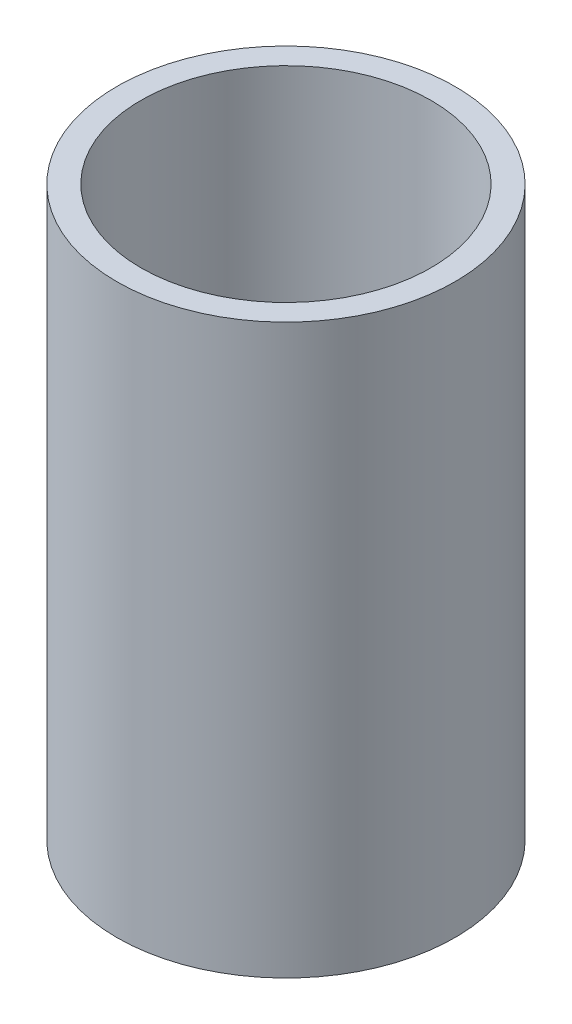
ISO-10303-21;
HEADER;
FILE_DESCRIPTION(('STEP AP214'),'2;1');
FILE_NAME('part.step','',(''),(''),'','','');
FILE_SCHEMA(('AUTOMOTIVE_DESIGN { 1 0 10303 214 1 1 1 1 }'));
ENDSEC;
DATA;
#1=APPLICATION_CONTEXT('core data for automotive mechanical design processes');
#2=APPLICATION_PROTOCOL_DEFINITION('international standard','automotive_design',2000,#1);
#3=PRODUCT_CONTEXT('',#1,'mechanical');
#4=PRODUCT('Part','Part','',(#3));
#5=PRODUCT_RELATED_PRODUCT_CATEGORY('part','',(#4));
#6=PRODUCT_DEFINITION_FORMATION('','',#4);
#7=PRODUCT_DEFINITION_CONTEXT('part definition',#1,'design');
#8=PRODUCT_DEFINITION('design','',#6,#7);
#9=PRODUCT_DEFINITION_SHAPE('','',#8);
#10=(LENGTH_UNIT() NAMED_UNIT(*) SI_UNIT(.MILLI.,.METRE.));
#11=(NAMED_UNIT(*) PLANE_ANGLE_UNIT() SI_UNIT($,.RADIAN.));
#12=(NAMED_UNIT(*) SI_UNIT($,.STERADIAN.) SOLID_ANGLE_UNIT());
#13=UNCERTAINTY_MEASURE_WITH_UNIT(LENGTH_MEASURE(1.E-05),#10,'distance_accuracy_value','');
#14=(GEOMETRIC_REPRESENTATION_CONTEXT(3) GLOBAL_UNCERTAINTY_ASSIGNED_CONTEXT((#13)) GLOBAL_UNIT_ASSIGNED_CONTEXT((#10,
#11,#12)) REPRESENTATION_CONTEXT('',''));
#15=CARTESIAN_POINT('',(0.,0.,0.));
#16=DIRECTION('',(0.,0.,1.));
#17=DIRECTION('',(1.,0.,0.));
#18=AXIS2_PLACEMENT_3D('',#15,#16,#17);
#19=CARTESIAN_POINT('',(0.,279.4,0.));
#20=DIRECTION('',(0.,1.,0.));
#21=DIRECTION('',(0.,0.,1.));
#22=AXIS2_PLACEMENT_3D('',#19,#20,#21);
#23=PLANE('',#22);
#24=CARTESIAN_POINT('',(0.,279.4,0.));
#25=DIRECTION('',(0.,1.,0.));
#26=DIRECTION('',(0.,0.,1.));
#27=AXIS2_PLACEMENT_3D('',#24,#25,#26);
#28=CIRCLE('',#27,83.185);
#29=CARTESIAN_POINT('',(0.,279.4,83.185));
#30=VERTEX_POINT('',#29);
#31=EDGE_CURVE('E42',#30,#30,#28,.T.);
#32=ORIENTED_EDGE('',*,*,#31,.T.);
#33=EDGE_LOOP('',(#32));
#34=FACE_BOUND('',#33,.T.);
#35=CARTESIAN_POINT('',(0.,279.4,0.));
#36=DIRECTION('',(0.,1.,0.));
#37=DIRECTION('',(0.,0.,1.));
#38=AXIS2_PLACEMENT_3D('',#35,#36,#37);
#39=CIRCLE('',#38,71.352522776);
#40=CARTESIAN_POINT('',(0.,279.4,71.352522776));
#41=VERTEX_POINT('',#40);
#42=EDGE_CURVE('E51',#41,#41,#39,.T.);
#43=ORIENTED_EDGE('',*,*,#42,.F.);
#44=EDGE_LOOP('',(#43));
#45=FACE_BOUND('',#44,.T.);
#46=ADVANCED_FACE('F35',(#34,#45),#23,.T.);
#47=CARTESIAN_POINT('',(0.,0.,0.));
#48=DIRECTION('',(0.,1.,0.));
#49=DIRECTION('',(0.,0.,1.));
#50=AXIS2_PLACEMENT_3D('',#47,#48,#49);
#51=PLANE('',#50);
#52=CARTESIAN_POINT('',(0.,0.,0.));
#53=DIRECTION('',(0.,1.,0.));
#54=DIRECTION('',(0.,0.,1.));
#55=AXIS2_PLACEMENT_3D('',#52,#53,#54);
#56=CIRCLE('',#55,83.185);
#57=CARTESIAN_POINT('',(0.,0.,83.185));
#58=VERTEX_POINT('',#57);
#59=EDGE_CURVE('E46',#58,#58,#56,.T.);
#60=ORIENTED_EDGE('',*,*,#59,.F.);
#61=EDGE_LOOP('',(#60));
#62=FACE_BOUND('',#61,.T.);
#63=CARTESIAN_POINT('',(0.,0.,0.));
#64=DIRECTION('',(0.,-1.,0.));
#65=DIRECTION('',(0.,0.,-1.));
#66=AXIS2_PLACEMENT_3D('',#63,#64,#65);
#67=CIRCLE('',#66,68.177522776);
#68=CARTESIAN_POINT('',(0.,0.,-68.177522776));
#69=VERTEX_POINT('',#68);
#70=EDGE_CURVE('E55',#69,#69,#67,.T.);
#71=ORIENTED_EDGE('',*,*,#70,.F.);
#72=EDGE_LOOP('',(#71));
#73=FACE_BOUND('',#72,.T.);
#74=ADVANCED_FACE('F61',(#62,#73),#51,.F.);
#75=CARTESIAN_POINT('',(0.,279.4,0.));
#76=DIRECTION('',(0.,-1.,0.));
#77=DIRECTION('',(0.,0.,-1.));
#78=AXIS2_PLACEMENT_3D('',#75,#76,#77);
#79=CYLINDRICAL_SURFACE('',#78,83.185);
#80=ORIENTED_EDGE('',*,*,#31,.F.);
#81=EDGE_LOOP('',(#80));
#82=FACE_BOUND('',#81,.T.);
#83=ORIENTED_EDGE('',*,*,#59,.T.);
#84=EDGE_LOOP('',(#83));
#85=FACE_BOUND('',#84,.T.);
#86=ADVANCED_FACE('F37',(#82,#85),#79,.T.);
#87=CARTESIAN_POINT('',(0.,279.4,0.));
#88=DIRECTION('',(0.,-1.,0.));
#89=DIRECTION('',(0.,0.,-1.));
#90=AXIS2_PLACEMENT_3D('',#87,#88,#89);
#91=CYLINDRICAL_SURFACE('',#90,71.352522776);
#92=CARTESIAN_POINT('',(0.,3.17499999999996,0.));
#93=DIRECTION('',(0.,1.,0.));
#94=DIRECTION('',(0.,0.,1.));
#95=AXIS2_PLACEMENT_3D('',#92,#93,#94);
#96=CIRCLE('',#95,71.352522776);
#97=CARTESIAN_POINT('',(0.,3.17499999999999,71.352522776));
#98=VERTEX_POINT('',#97);
#99=EDGE_CURVE('E10',#98,#98,#96,.T.);
#100=ORIENTED_EDGE('',*,*,#99,.F.);
#101=EDGE_LOOP('',(#100));
#102=FACE_BOUND('',#101,.T.);
#103=ORIENTED_EDGE('',*,*,#42,.T.);
#104=EDGE_LOOP('',(#103));
#105=FACE_BOUND('',#104,.T.);
#106=ADVANCED_FACE('F69',(#102,#105),#91,.F.);
#107=CARTESIAN_POINT('',(0.,3.17500000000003,0.));
#108=DIRECTION('',(0.,1.,0.));
#109=DIRECTION('',(0.,0.,1.));
#110=AXIS2_PLACEMENT_3D('',#107,#108,#109);
#111=CONICAL_SURFACE('',#110,71.3525227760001,0.785398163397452);
#112=ORIENTED_EDGE('',*,*,#70,.T.);
#113=EDGE_LOOP('',(#112));
#114=FACE_BOUND('',#113,.T.);
#115=ORIENTED_EDGE('',*,*,#99,.T.);
#116=EDGE_LOOP('',(#115));
#117=FACE_BOUND('',#116,.T.);
#118=ADVANCED_FACE('F59',(#114,#117),#111,.F.);
#119=CLOSED_SHELL('',(#46,#74,#86,#106,#118));
#120=MANIFOLD_SOLID_BREP('B2',#119);
#121=ADVANCED_BREP_SHAPE_REPRESENTATION('',(#18,#120),#14);
#122=SHAPE_DEFINITION_REPRESENTATION(#9,#121);
ENDSEC;
END-ISO-10303-21;
